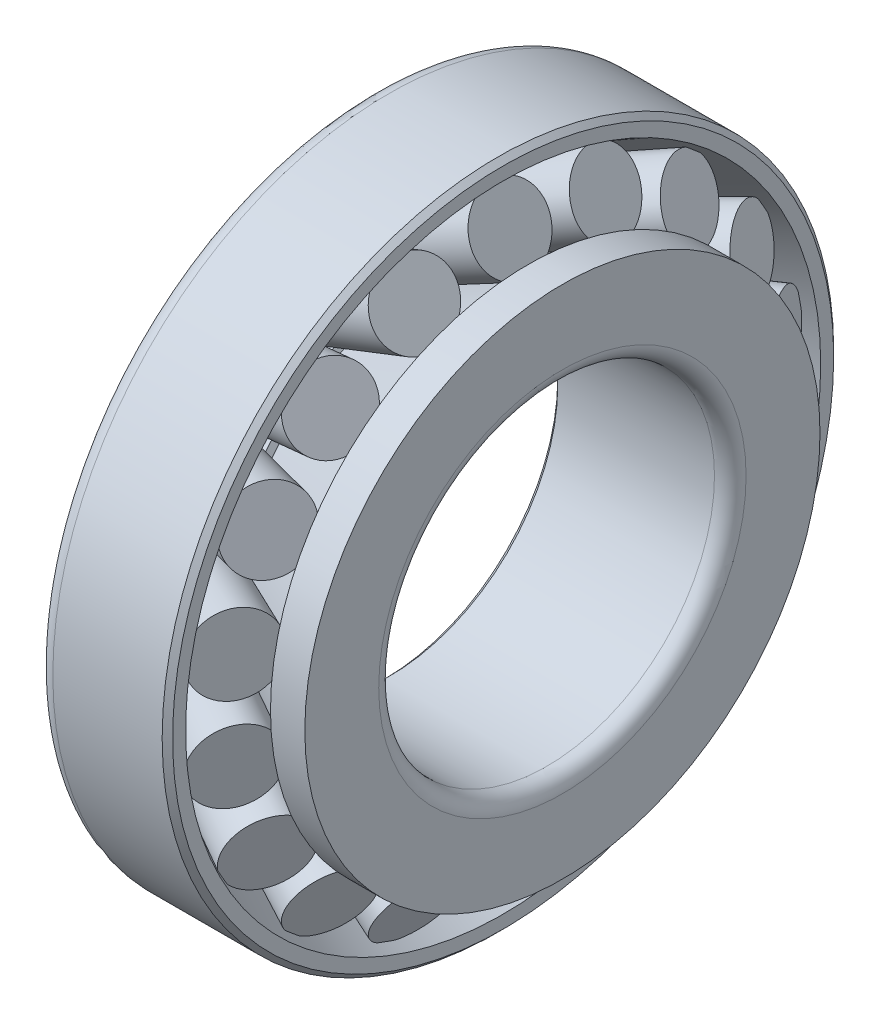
from build123d import *

# Parameters (mm, degrees)
ROLLERSDETAILED_COUNT = 18
ROLLERSDETAILED_ANGLE = 340


with BuildPart() as part:
    # OutRacSke → OuterRace (revolve)
    with BuildSketch(Plane.XY, mode=Mode.PRIVATE) as outerrace_sk:
        with BuildLine():
            Line((-15, 80.389973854), (-48, 62.814))
            Line((-48, 62.814), (-48, 81))
            ThreePointArc((-48, 81), (-46.828427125, 83.828427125), (-44, 85))
            Line((-44, 85), (-16.32, 85))
            Line((-16.32, 85), (-15, 83.68))
            Line((-15, 83.68), (-15, 80.389973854))
        make_face()
    revolve(outerrace_sk.sketch.rotate(Axis((-42.5, 0, 0), (1, 0, 0)), 270), axis=Axis((-42.5, 0, 0), (1, 0, 0)))

    # RolDetSke → RollerDetailed (revolve)
    with BuildSketch(Plane.XY):
        Polygon((-39.475404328, 56.773929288), (-44, 65.269143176), (-17.786197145, 79.230752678), (-13.261601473, 70.73553879), align=None)
    rollerdetailed = revolve(axis=Axis((-49.062875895, 51.667591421, 0), (0.8826196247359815, 0.4700878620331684, 0)))

    # RollersDetailed: RollerDetailed ×18 about axis
    rollersdetailed_axis = Axis((-50, 0, 0), (1, 0, 0))
    for i in range(1, ROLLERSDETAILED_COUNT):
        add(rollerdetailed.rotate(rollersdetailed_axis, i * ROLLERSDETAILED_ANGLE / (ROLLERSDETAILED_COUNT - 1)))

    # InsRacSke → InnerRace (revolve)
    with BuildSketch(Plane.XY, mode=Mode.PRIVATE) as innerrace_sk:
        with BuildLine():
            Line((-35.696481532, 49.763715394), (-45, 49.763715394))
            Line((-45, 49.763715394), (-45, 43.82))
            Line((-45, 43.82), (-43.68, 42.5))
            Line((-43.68, 42.5), (-4, 42.5))
            ThreePointArc((-4, 42.5), (-1.171572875, 43.671572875), (0, 46.5))
            Line((0, 46.5), (0, 65.210324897))
            Line((0, 65.210324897), (-8.691759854, 65.210324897))
            Line((-8.691759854, 65.210324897), (-8.691759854, 62.240324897))
            Line((-8.691759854, 62.240324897), (-34.905562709, 48.278715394))
            Line((-34.905562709, 48.278715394), (-35.696481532, 49.763715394))
        make_face()
    revolve(innerrace_sk.sketch.rotate(Axis((-42.5, 0, 0), (1, 0, 0)), 270), axis=Axis((-42.5, 0, 0), (1, 0, 0)))


solid = part.part
